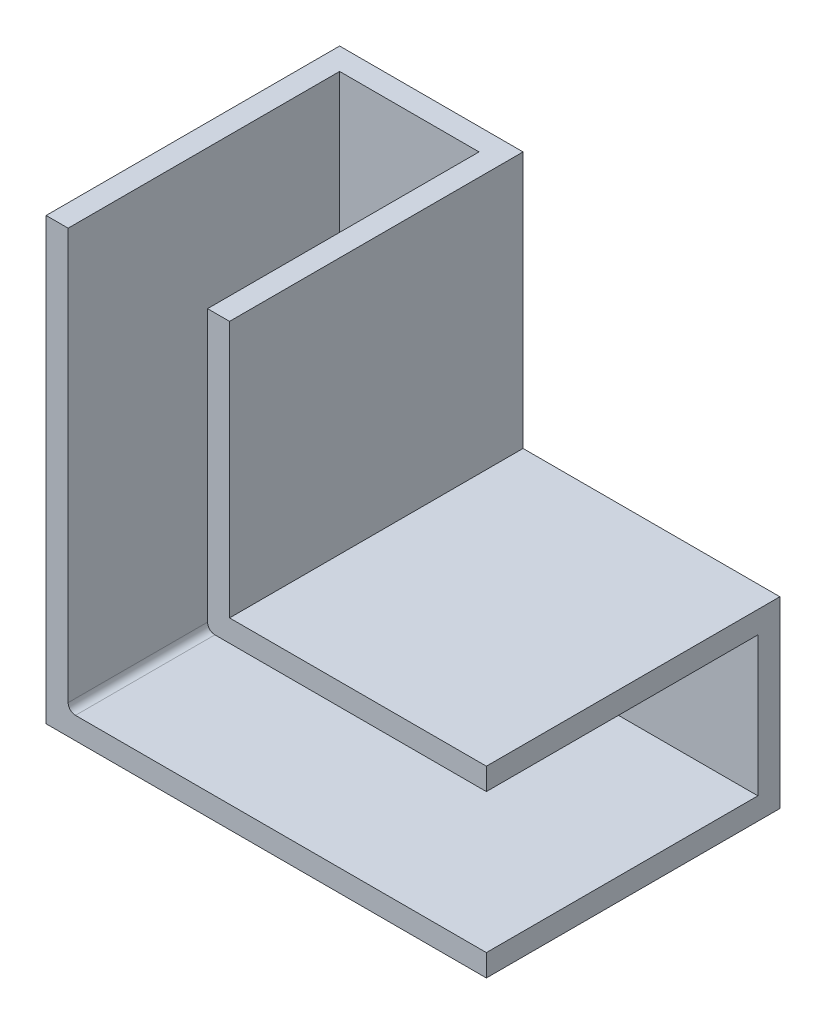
from build123d import *

# Parameters (mm, degrees)
BOSS_EXTRUDE1_DEPTH = 40
SHELL3_T            = -3
FILLET1_R           = 1


with BuildPart() as part:
    # Sketch1 → Boss-Extrude1 (new body)
    with BuildSketch(Plane.XY):
        Polygon((-50.571428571, 22.642857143), (-25.571428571, 22.642857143), (-25.571428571, -12.357142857), (9.428571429, -12.357142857), (9.428571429, -37.357142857), (-50.571428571, -37.357142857), align=None)
    extrude(amount=BOSS_EXTRUDE1_DEPTH)

    # Shell3
    shell3_openings = [part.faces().sort_by_distance(p)[0] for p in [
        (-27.018796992, -13.804511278, 40),
        (-38.071428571, 22.642857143, 20),
        (9.428571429, -24.857142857, 20),
    ]]
    offset(amount=SHELL3_T, openings=shell3_openings, kind=Kind.INTERSECTION)

    # Fillet1
    fillet1_edges = [part.edges().sort_by_distance(p)[0] for p in [
        (-47.571428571, -34.357142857, 21.5),
        (-28.571428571, -15.357142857, 21.5),
    ]]
    fillet(fillet1_edges, radius=FILLET1_R)


solid = part.part
